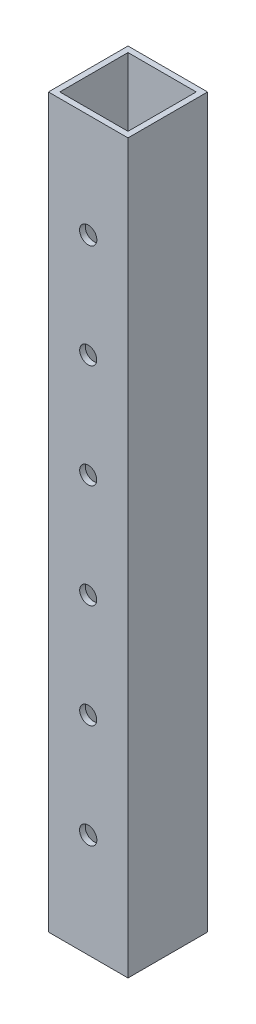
from build123d import *

# Parameters (mm, degrees)
SKETCH1_W           = 44.45
SKETCH1_H           = 44.45
SKETCH1_W_2         = 38.1
SKETCH1_H_2         = 38.1
BOSS_EXTRUDE1_DEPTH = 406.4
HOLE_SKETCH_R       = 4.826
HOLE_SKETCH_R_2     = 4.7625
CUT_EXTRUDE1_DEPTH  = 410.821050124


with BuildPart() as part:
    # Sketch1 → Boss-Extrude1 (new body)
    with BuildSketch(Plane(origin=(0, 0, 0), x_dir=(1, 0, 0), z_dir=(0, 1, 0))):
        with Locations((-6.35, -6.35)):
            Rectangle(SKETCH1_W, SKETCH1_H)
        with Locations((-6.35, -6.35)):
            Rectangle(SKETCH1_W_2, SKETCH1_H_2, mode=Mode.SUBTRACT)
    extrude(amount=BOSS_EXTRUDE1_DEPTH)

    # hole sketch → Cut-Extrude1 (cut, through all)
    with BuildSketch(Plane(origin=(0, 0, -15.875), x_dir=(-1, 0, 0), z_dir=(0, 0, -1))):
        with Locations((6.35, 348.342857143)):
            Circle(HOLE_SKETCH_R)
        with Locations((6.35, 290.285714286)):
            Circle(HOLE_SKETCH_R_2)
        with Locations((6.35, 232.228571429)):
            Circle(HOLE_SKETCH_R_2)
    cut_extrude1 = extrude(amount=-CUT_EXTRUDE1_DEPTH, mode=Mode.SUBTRACT)

    # mirror for holes: Cut-Extrude1 across plane
    add(cut_extrude1.mirror(Plane.ZX.offset(203.2)), mode=Mode.SUBTRACT)


solid = part.part
